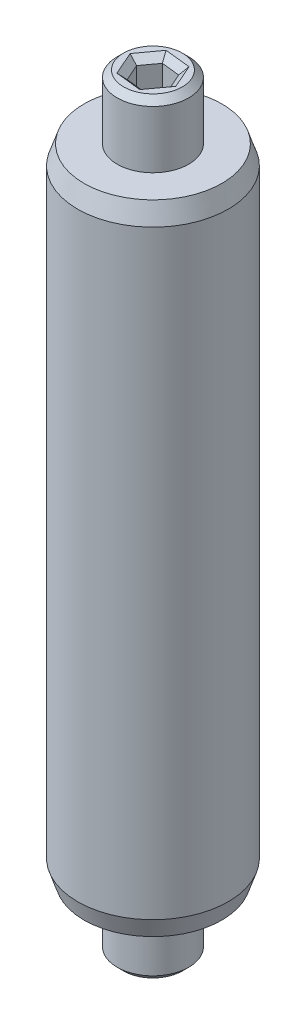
ISO-10303-21;
HEADER;
FILE_DESCRIPTION(('STEP AP214'),'2;1');
FILE_NAME('part.step','',(''),(''),'','','');
FILE_SCHEMA(('AUTOMOTIVE_DESIGN { 1 0 10303 214 1 1 1 1 }'));
ENDSEC;
DATA;
#1=APPLICATION_CONTEXT('core data for automotive mechanical design processes');
#2=APPLICATION_PROTOCOL_DEFINITION('international standard','automotive_design',2000,#1);
#3=PRODUCT_CONTEXT('',#1,'mechanical');
#4=PRODUCT('Part','Part','',(#3));
#5=PRODUCT_RELATED_PRODUCT_CATEGORY('part','',(#4));
#6=PRODUCT_DEFINITION_FORMATION('','',#4);
#7=PRODUCT_DEFINITION_CONTEXT('part definition',#1,'design');
#8=PRODUCT_DEFINITION('design','',#6,#7);
#9=PRODUCT_DEFINITION_SHAPE('','',#8);
#10=(LENGTH_UNIT() NAMED_UNIT(*) SI_UNIT(.MILLI.,.METRE.));
#11=(NAMED_UNIT(*) PLANE_ANGLE_UNIT() SI_UNIT($,.RADIAN.));
#12=(NAMED_UNIT(*) SI_UNIT($,.STERADIAN.) SOLID_ANGLE_UNIT());
#13=UNCERTAINTY_MEASURE_WITH_UNIT(LENGTH_MEASURE(1.E-05),#10,'distance_accuracy_value','');
#14=(GEOMETRIC_REPRESENTATION_CONTEXT(3) GLOBAL_UNCERTAINTY_ASSIGNED_CONTEXT((#13)) GLOBAL_UNIT_ASSIGNED_CONTEXT((#10,
#11,#12)) REPRESENTATION_CONTEXT('',''));
#15=CARTESIAN_POINT('',(0.,0.,0.));
#16=DIRECTION('',(0.,0.,1.));
#17=DIRECTION('',(1.,0.,0.));
#18=AXIS2_PLACEMENT_3D('',#15,#16,#17);
#19=CARTESIAN_POINT('',(-1.06592274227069,15.1859369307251,-1.12643595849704));
#20=DIRECTION('',(0.,-1.,0.));
#21=DIRECTION('',(0.,0.,-1.));
#22=AXIS2_PLACEMENT_3D('',#19,#20,#21);
#23=PLANE('',#22);
#24=CARTESIAN_POINT('',(-1.06592274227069,15.1859369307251,-1.12643595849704));
#25=DIRECTION('',(0.,-1.,0.));
#26=DIRECTION('',(0.,0.,-1.));
#27=AXIS2_PLACEMENT_3D('',#24,#25,#26);
#28=CIRCLE('',#27,1.3843);
#29=CARTESIAN_POINT('',(-1.06592274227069,15.1859369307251,0.257864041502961));
#30=VERTEX_POINT('',#29);
#31=EDGE_CURVE('P0_E11',#30,#30,#28,.T.);
#32=ORIENTED_EDGE('',*,*,#31,.T.);
#33=EDGE_LOOP('',(#32));
#34=FACE_BOUND('',#33,.T.);
#35=CARTESIAN_POINT('',(-1.06592274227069,15.1859369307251,-1.12643595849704));
#36=DIRECTION('',(0.,1.,0.));
#37=DIRECTION('',(0.,0.,1.));
#38=AXIS2_PLACEMENT_3D('',#35,#36,#37);
#39=CIRCLE('',#38,2.7432);
#40=CARTESIAN_POINT('',(-1.06592274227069,15.1859369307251,1.61676404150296));
#41=VERTEX_POINT('',#40);
#42=EDGE_CURVE('P0_E54',#41,#41,#39,.T.);
#43=ORIENTED_EDGE('',*,*,#42,.T.);
#44=EDGE_LOOP('',(#43));
#45=FACE_BOUND('',#44,.T.);
#46=ADVANCED_FACE('P0_F16',(#34,#45),#23,.F.);
#47=CARTESIAN_POINT('',(-1.06592274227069,14.4239369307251,-1.12643595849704));
#48=DIRECTION('',(0.,-1.,0.));
#49=DIRECTION('',(0.,0.,-1.));
#50=AXIS2_PLACEMENT_3D('',#47,#48,#49);
#51=CONICAL_SURFACE('',#50,2.9972,0.321750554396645);
#52=ORIENTED_EDGE('',*,*,#42,.F.);
#53=EDGE_LOOP('',(#52));
#54=FACE_BOUND('',#53,.T.);
#55=CARTESIAN_POINT('',(-1.06592274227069,14.4239369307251,-1.12643595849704));
#56=DIRECTION('',(0.,1.,0.));
#57=DIRECTION('',(0.,0.,1.));
#58=AXIS2_PLACEMENT_3D('',#55,#56,#57);
#59=CIRCLE('',#58,2.9972);
#60=CARTESIAN_POINT('',(-1.06592274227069,14.4239369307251,1.87076404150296));
#61=VERTEX_POINT('',#60);
#62=EDGE_CURVE('P0_E51',#61,#61,#59,.T.);
#63=ORIENTED_EDGE('',*,*,#62,.T.);
#64=EDGE_LOOP('',(#63));
#65=FACE_BOUND('',#64,.T.);
#66=ADVANCED_FACE('P0_F75',(#54,#65),#51,.T.);
#67=CARTESIAN_POINT('',(-1.06592274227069,15.1859369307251,-1.12643595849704));
#68=DIRECTION('',(0.,1.,0.));
#69=DIRECTION('',(0.,0.,1.));
#70=AXIS2_PLACEMENT_3D('',#67,#68,#69);
#71=CYLINDRICAL_SURFACE('',#70,2.9972);
#72=ORIENTED_EDGE('',*,*,#62,.F.);
#73=EDGE_LOOP('',(#72));
#74=FACE_BOUND('',#73,.T.);
#75=CARTESIAN_POINT('',(-1.06592274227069,-9.45206306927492,-1.12643595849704));
#76=DIRECTION('',(0.,1.,0.));
#77=DIRECTION('',(0.,0.,1.));
#78=AXIS2_PLACEMENT_3D('',#75,#76,#77);
#79=CIRCLE('',#78,2.9972);
#80=CARTESIAN_POINT('',(-1.06592274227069,-9.45206306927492,1.87076404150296));
#81=VERTEX_POINT('',#80);
#82=EDGE_CURVE('P0_E48',#81,#81,#79,.T.);
#83=ORIENTED_EDGE('',*,*,#82,.T.);
#84=EDGE_LOOP('',(#83));
#85=FACE_BOUND('',#84,.T.);
#86=ADVANCED_FACE('P0_F81',(#74,#85),#71,.T.);
#87=CARTESIAN_POINT('',(-1.06592274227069,-10.2140630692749,-1.12643595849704));
#88=DIRECTION('',(0.,1.,0.));
#89=DIRECTION('',(0.,0.,1.));
#90=AXIS2_PLACEMENT_3D('',#87,#88,#89);
#91=CONICAL_SURFACE('',#90,2.7432,0.321750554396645);
#92=ORIENTED_EDGE('',*,*,#82,.F.);
#93=EDGE_LOOP('',(#92));
#94=FACE_BOUND('',#93,.T.);
#95=CARTESIAN_POINT('',(-1.06592274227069,-10.2140630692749,-1.12643595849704));
#96=DIRECTION('',(0.,1.,0.));
#97=DIRECTION('',(0.,0.,1.));
#98=AXIS2_PLACEMENT_3D('',#95,#96,#97);
#99=CIRCLE('',#98,2.7432);
#100=CARTESIAN_POINT('',(-1.06592274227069,-10.2140630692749,1.61676404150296));
#101=VERTEX_POINT('',#100);
#102=EDGE_CURVE('P0_E43',#101,#101,#99,.T.);
#103=ORIENTED_EDGE('',*,*,#102,.T.);
#104=EDGE_LOOP('',(#103));
#105=FACE_BOUND('',#104,.T.);
#106=ADVANCED_FACE('P0_F88',(#94,#105),#91,.T.);
#107=CARTESIAN_POINT('',(1.67727725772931,-10.2140630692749,-1.12643595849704));
#108=DIRECTION('',(0.,1.,0.));
#109=DIRECTION('',(0.,0.,1.));
#110=AXIS2_PLACEMENT_3D('',#107,#108,#109);
#111=PLANE('',#110);
#112=CARTESIAN_POINT('',(-1.06592274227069,-10.2140630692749,-1.12643595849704));
#113=DIRECTION('',(0.,1.,0.));
#114=DIRECTION('',(0.,0.,1.));
#115=AXIS2_PLACEMENT_3D('',#112,#113,#114);
#116=CIRCLE('',#115,1.3843);
#117=CARTESIAN_POINT('',(-1.06592274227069,-10.2140630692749,-2.51073595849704));
#118=VERTEX_POINT('',#117);
#119=EDGE_CURVE('P0_E60',#118,#118,#116,.T.);
#120=ORIENTED_EDGE('',*,*,#119,.T.);
#121=EDGE_LOOP('',(#120));
#122=FACE_BOUND('',#121,.T.);
#123=ORIENTED_EDGE('',*,*,#102,.F.);
#124=EDGE_LOOP('',(#123));
#125=FACE_BOUND('',#124,.T.);
#126=ADVANCED_FACE('P0_F92',(#122,#125),#111,.F.);
#127=CARTESIAN_POINT('',(-1.06592274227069,-10.2140630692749,-1.12643595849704));
#128=DIRECTION('',(0.,-1.,0.));
#129=DIRECTION('',(0.,0.,-1.));
#130=AXIS2_PLACEMENT_3D('',#127,#128,#129);
#131=CYLINDRICAL_SURFACE('',#130,1.1303);
#132=CARTESIAN_POINT('',(-1.06592274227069,-9.77412216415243,-1.12643595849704));
#133=DIRECTION('',(0.,1.,0.));
#134=DIRECTION('',(0.,0.,1.));
#135=AXIS2_PLACEMENT_3D('',#132,#133,#134);
#136=CIRCLE('',#135,1.1303);
#137=CARTESIAN_POINT('',(-1.06592274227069,-9.77412216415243,-2.25673595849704));
#138=VERTEX_POINT('',#137);
#139=EDGE_CURVE('P0_E57',#138,#138,#136,.F.);
#140=ORIENTED_EDGE('',*,*,#139,.T.);
#141=EDGE_LOOP('',(#140));
#142=FACE_BOUND('',#141,.T.);
#143=CARTESIAN_POINT('',(-1.06592274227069,-4.49906306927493,-1.12643595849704));
#144=DIRECTION('',(0.,-1.,0.));
#145=DIRECTION('',(0.,0.,-1.));
#146=AXIS2_PLACEMENT_3D('',#143,#144,#145);
#147=CIRCLE('',#146,1.1303);
#148=CARTESIAN_POINT('',(-1.06592274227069,-4.49906306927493,-2.25673595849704));
#149=VERTEX_POINT('',#148);
#150=EDGE_CURVE('P0_E40',#149,#149,#147,.T.);
#151=ORIENTED_EDGE('',*,*,#150,.F.);
#152=EDGE_LOOP('',(#151));
#153=FACE_BOUND('',#152,.T.);
#154=ADVANCED_FACE('P0_F96',(#142,#153),#131,.F.);
#155=CARTESIAN_POINT('',(-1.06592274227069,-4.49906306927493,-1.12643595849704));
#156=DIRECTION('',(0.,-1.,0.));
#157=DIRECTION('',(0.,0.,-1.));
#158=AXIS2_PLACEMENT_3D('',#155,#156,#157);
#159=CONICAL_SURFACE('',#158,1.1303,1.02974425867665);
#160=CARTESIAN_POINT('',(-1.06592274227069,-3.81991031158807,-1.12643595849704));
#161=VERTEX_POINT('',#160);
#162=VERTEX_LOOP('',#161);
#163=FACE_BOUND('',#162,.T.);
#164=ORIENTED_EDGE('',*,*,#150,.T.);
#165=EDGE_LOOP('',(#164));
#166=FACE_BOUND('',#165,.T.);
#167=ADVANCED_FACE('P0_F100',(#163,#166),#159,.F.);
#168=CARTESIAN_POINT('',(-1.06592274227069,15.1859369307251,-1.12643595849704));
#169=DIRECTION('',(0.,1.,0.));
#170=DIRECTION('',(0.,0.,1.));
#171=AXIS2_PLACEMENT_3D('',#168,#169,#170);
#172=CYLINDRICAL_SURFACE('',#171,1.1303);
#173=CARTESIAN_POINT('',(-1.06592274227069,14.7459960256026,-1.12643595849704));
#174=DIRECTION('',(0.,-1.,0.));
#175=DIRECTION('',(0.,0.,-1.));
#176=AXIS2_PLACEMENT_3D('',#173,#174,#175);
#177=CIRCLE('',#176,1.1303);
#178=CARTESIAN_POINT('',(-1.06592274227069,14.7459960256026,0.00386404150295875));
#179=VERTEX_POINT('',#178);
#180=EDGE_CURVE('P0_E24',#179,#179,#177,.F.);
#181=ORIENTED_EDGE('',*,*,#180,.T.);
#182=EDGE_LOOP('',(#181));
#183=FACE_BOUND('',#182,.T.);
#184=CARTESIAN_POINT('',(-1.06592274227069,9.47093693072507,-1.12643595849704));
#185=DIRECTION('',(0.,1.,0.));
#186=DIRECTION('',(0.,0.,1.));
#187=AXIS2_PLACEMENT_3D('',#184,#185,#186);
#188=CIRCLE('',#187,1.1303);
#189=CARTESIAN_POINT('',(-1.06592274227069,9.47093693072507,0.00386404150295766));
#190=VERTEX_POINT('',#189);
#191=EDGE_CURVE('P0_E38',#190,#190,#188,.T.);
#192=ORIENTED_EDGE('',*,*,#191,.F.);
#193=EDGE_LOOP('',(#192));
#194=FACE_BOUND('',#193,.T.);
#195=ADVANCED_FACE('P0_F34',(#183,#194),#172,.F.);
#196=CARTESIAN_POINT('',(-1.06592274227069,9.47093693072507,-1.12643595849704));
#197=DIRECTION('',(0.,1.,0.));
#198=DIRECTION('',(0.,0.,1.));
#199=AXIS2_PLACEMENT_3D('',#196,#197,#198);
#200=CONICAL_SURFACE('',#199,1.1303,1.02974425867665);
#201=CARTESIAN_POINT('',(-1.06592274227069,8.79178417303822,-1.12643595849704));
#202=VERTEX_POINT('',#201);
#203=VERTEX_LOOP('',#202);
#204=FACE_BOUND('',#203,.T.);
#205=ORIENTED_EDGE('',*,*,#191,.T.);
#206=EDGE_LOOP('',(#205));
#207=FACE_BOUND('',#206,.T.);
#208=ADVANCED_FACE('P0_F30',(#204,#207),#200,.F.);
#209=CARTESIAN_POINT('',(-1.06592274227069,-9.77412216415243,-1.12643595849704));
#210=DIRECTION('',(0.,-1.,0.));
#211=DIRECTION('',(0.,0.,-1.));
#212=AXIS2_PLACEMENT_3D('',#209,#210,#211);
#213=CONICAL_SURFACE('',#212,1.1303,0.5235987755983);
#214=CARTESIAN_POINT('',(-1.06592274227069,-10.2140630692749,-2.51073595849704));
#215=CARTESIAN_POINT('',(-1.06592274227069,-10.2094803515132,-2.50809012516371));
#216=CARTESIAN_POINT('',(-1.06592274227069,-10.2048976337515,-2.50544429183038));
#217=CARTESIAN_POINT('',(-1.06592274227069,-10.1957321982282,-2.50015262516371));
#218=CARTESIAN_POINT('',(-1.06592274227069,-10.1911494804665,-2.49750679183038));
#219=CARTESIAN_POINT('',(-1.06592274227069,-10.1819840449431,-2.49221512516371));
#220=CARTESIAN_POINT('',(-1.06592274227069,-10.1774013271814,-2.48956929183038));
#221=CARTESIAN_POINT('',(-1.06592274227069,-10.168235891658,-2.48427762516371));
#222=CARTESIAN_POINT('',(-1.06592274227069,-10.1636531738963,-2.48163179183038));
#223=CARTESIAN_POINT('',(-1.06592274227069,-10.1544877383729,-2.47634012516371));
#224=CARTESIAN_POINT('',(-1.06592274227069,-10.1499050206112,-2.47369429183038));
#225=CARTESIAN_POINT('',(-1.06592274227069,-10.1407395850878,-2.46840262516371));
#226=CARTESIAN_POINT('',(-1.06592274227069,-10.1361568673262,-2.46575679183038));
#227=CARTESIAN_POINT('',(-1.06592274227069,-10.1269914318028,-2.46046512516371));
#228=CARTESIAN_POINT('',(-1.06592274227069,-10.1224087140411,-2.45781929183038));
#229=CARTESIAN_POINT('',(-1.06592274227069,-10.1132432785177,-2.45252762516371));
#230=CARTESIAN_POINT('',(-1.06592274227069,-10.108660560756,-2.44988179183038));
#231=CARTESIAN_POINT('',(-1.06592274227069,-10.0994951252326,-2.44459012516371));
#232=CARTESIAN_POINT('',(-1.06592274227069,-10.0949124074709,-2.44194429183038));
#233=CARTESIAN_POINT('',(-1.06592274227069,-10.0857469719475,-2.43665262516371));
#234=CARTESIAN_POINT('',(-1.06592274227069,-10.0811642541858,-2.43400679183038));
#235=CARTESIAN_POINT('',(-1.06592274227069,-10.0719988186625,-2.42871512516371));
#236=CARTESIAN_POINT('',(-1.06592274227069,-10.0674161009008,-2.42606929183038));
#237=CARTESIAN_POINT('',(-1.06592274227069,-10.0582506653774,-2.42077762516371));
#238=CARTESIAN_POINT('',(-1.06592274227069,-10.0536679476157,-2.41813179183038));
#239=CARTESIAN_POINT('',(-1.06592274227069,-10.0445025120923,-2.41284012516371));
#240=CARTESIAN_POINT('',(-1.06592274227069,-10.0399197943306,-2.41019429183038));
#241=CARTESIAN_POINT('',(-1.06592274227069,-10.0307543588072,-2.40490262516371));
#242=CARTESIAN_POINT('',(-1.06592274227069,-10.0261716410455,-2.40225679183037));
#243=CARTESIAN_POINT('',(-1.06592274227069,-10.0170062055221,-2.39696512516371));
#244=CARTESIAN_POINT('',(-1.06592274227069,-10.0124234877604,-2.39431929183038));
#245=CARTESIAN_POINT('',(-1.06592274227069,-10.0032580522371,-2.38902762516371));
#246=CARTESIAN_POINT('',(-1.06592274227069,-9.99867533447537,-2.38638179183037));
#247=CARTESIAN_POINT('',(-1.06592274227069,-9.98950989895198,-2.38109012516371));
#248=CARTESIAN_POINT('',(-1.06592274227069,-9.98492718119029,-2.37844429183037));
#249=CARTESIAN_POINT('',(-1.06592274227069,-9.97576174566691,-2.37315262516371));
#250=CARTESIAN_POINT('',(-1.06592274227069,-9.97117902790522,-2.37050679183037));
#251=CARTESIAN_POINT('',(-1.06592274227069,-9.96201359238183,-2.36521512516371));
#252=CARTESIAN_POINT('',(-1.06592274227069,-9.95743087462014,-2.36256929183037));
#253=CARTESIAN_POINT('',(-1.06592274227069,-9.94826543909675,-2.35727762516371));
#254=CARTESIAN_POINT('',(-1.06592274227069,-9.94368272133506,-2.35463179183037));
#255=CARTESIAN_POINT('',(-1.06592274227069,-9.93451728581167,-2.34934012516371));
#256=CARTESIAN_POINT('',(-1.06592274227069,-9.92993456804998,-2.34669429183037));
#257=CARTESIAN_POINT('',(-1.06592274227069,-9.92076913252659,-2.34140262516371));
#258=CARTESIAN_POINT('',(-1.06592274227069,-9.9161864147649,-2.33875679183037));
#259=CARTESIAN_POINT('',(-1.06592274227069,-9.90702097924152,-2.33346512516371));
#260=CARTESIAN_POINT('',(-1.06592274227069,-9.90243826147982,-2.33081929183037));
#261=CARTESIAN_POINT('',(-1.06592274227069,-9.89327282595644,-2.32552762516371));
#262=CARTESIAN_POINT('',(-1.06592274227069,-9.88869010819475,-2.32288179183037));
#263=CARTESIAN_POINT('',(-1.06592274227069,-9.87952467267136,-2.31759012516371));
#264=CARTESIAN_POINT('',(-1.06592274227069,-9.87494195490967,-2.31494429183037));
#265=CARTESIAN_POINT('',(-1.06592274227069,-9.86577651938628,-2.30965262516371));
#266=CARTESIAN_POINT('',(-1.06592274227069,-9.86119380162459,-2.30700679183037));
#267=CARTESIAN_POINT('',(-1.06592274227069,-9.8520283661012,-2.30171512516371));
#268=CARTESIAN_POINT('',(-1.06592274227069,-9.84744564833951,-2.29906929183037));
#269=CARTESIAN_POINT('',(-1.06592274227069,-9.83828021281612,-2.29377762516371));
#270=CARTESIAN_POINT('',(-1.06592274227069,-9.83369749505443,-2.29113179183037));
#271=CARTESIAN_POINT('',(-1.06592274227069,-9.82453205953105,-2.28584012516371));
#272=CARTESIAN_POINT('',(-1.06592274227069,-9.81994934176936,-2.28319429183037));
#273=CARTESIAN_POINT('',(-1.06592274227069,-9.81078390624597,-2.27790262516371));
#274=CARTESIAN_POINT('',(-1.06592274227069,-9.80620118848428,-2.27525679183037));
#275=CARTESIAN_POINT('',(-1.06592274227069,-9.79703575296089,-2.26996512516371));
#276=CARTESIAN_POINT('',(-1.06592274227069,-9.7924530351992,-2.26731929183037));
#277=CARTESIAN_POINT('',(-1.06592274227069,-9.78328759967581,-2.26202762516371));
#278=CARTESIAN_POINT('',(-1.06592274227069,-9.77870488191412,-2.25938179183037));
#279=CARTESIAN_POINT('',(-1.06592274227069,-9.77412216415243,-2.25673595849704));
#280=B_SPLINE_CURVE_WITH_KNOTS('',3,(#214,#215,#216,#217,#218,#219,#220,#221,#222,#223,#224,
#225,#226,#227,#228,#229,#230,#231,#232,#233,#234,#235,#236,#237,#238,#239,#240,#241,#242,#243,
#244,#245,#246,#247,#248,#249,#250,#251,#252,#253,#254,#255,#256,#257,#258,#259,#260,#261,#262,
#263,#264,#265,#266,#267,#268,#269,#270,#271,#272,#273,#274,#275,#276,#277,#278,#279),
.UNSPECIFIED.,.F.,.F.,(4,2,2,2,2,2,2,2,2,2,2,2,2,2,2,2,2,2,2,2,2,2,2,2,2,2,2,2,2,2,2,2,4),(0.,
0.0158750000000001,0.0317500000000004,0.0476250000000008,0.0635000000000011,0.0793750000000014,
0.0952500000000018,0.111125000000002,0.127000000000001,0.142875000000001,0.158750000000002,
0.174625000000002,0.190500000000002,0.206375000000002,0.222250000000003,0.238125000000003,
0.254000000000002,0.269875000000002,0.285750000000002,0.301625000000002,0.317500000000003,
0.333375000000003,0.349250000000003,0.365125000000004,0.381000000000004,0.396875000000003,
0.412750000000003,0.428625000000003,0.444500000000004,0.460375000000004,0.476250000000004,
0.492125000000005,0.508000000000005),.UNSPECIFIED.);
#281=EDGE_CURVE('P0_BSEAM33',#118,#138,#280,.T.);
#282=ORIENTED_EDGE('',*,*,#119,.F.);
#283=ORIENTED_EDGE('',*,*,#139,.F.);
#284=ORIENTED_EDGE('',*,*,#281,.T.);
#285=ORIENTED_EDGE('',*,*,#281,.F.);
#286=EDGE_LOOP('',(#282,#284,#283,#285));
#287=FACE_BOUND('',#286,.T.);
#288=ADVANCED_FACE('P0_F33',(#287),#213,.F.);
#289=CARTESIAN_POINT('',(-1.06592274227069,14.7459960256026,-1.12643595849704));
#290=DIRECTION('',(0.,1.,0.));
#291=DIRECTION('',(0.,0.,1.));
#292=AXIS2_PLACEMENT_3D('',#289,#290,#291);
#293=CONICAL_SURFACE('',#292,1.1303,0.5235987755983);
#294=CARTESIAN_POINT('',(-1.06592274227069,15.1859369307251,0.257864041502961));
#295=CARTESIAN_POINT('',(-1.06592274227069,15.1813542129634,0.255218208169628));
#296=CARTESIAN_POINT('',(-1.06592274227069,15.1767714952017,0.252572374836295));
#297=CARTESIAN_POINT('',(-1.06592274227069,15.1676060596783,0.247280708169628));
#298=CARTESIAN_POINT('',(-1.06592274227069,15.1630233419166,0.244634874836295));
#299=CARTESIAN_POINT('',(-1.06592274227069,15.1538579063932,0.239343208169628));
#300=CARTESIAN_POINT('',(-1.06592274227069,15.1492751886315,0.236697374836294));
#301=CARTESIAN_POINT('',(-1.06592274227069,15.1401097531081,0.231405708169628));
#302=CARTESIAN_POINT('',(-1.06592274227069,15.1355270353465,0.228759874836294));
#303=CARTESIAN_POINT('',(-1.06592274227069,15.1263615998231,0.223468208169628));
#304=CARTESIAN_POINT('',(-1.06592274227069,15.1217788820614,0.220822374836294));
#305=CARTESIAN_POINT('',(-1.06592274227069,15.112613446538,0.215530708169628));
#306=CARTESIAN_POINT('',(-1.06592274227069,15.1080307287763,0.212884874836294));
#307=CARTESIAN_POINT('',(-1.06592274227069,15.0988652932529,0.207593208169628));
#308=CARTESIAN_POINT('',(-1.06592274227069,15.0942825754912,0.204947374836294));
#309=CARTESIAN_POINT('',(-1.06592274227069,15.0851171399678,0.199655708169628));
#310=CARTESIAN_POINT('',(-1.06592274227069,15.0805344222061,0.197009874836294));
#311=CARTESIAN_POINT('',(-1.06592274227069,15.0713689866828,0.191718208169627));
#312=CARTESIAN_POINT('',(-1.06592274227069,15.0667862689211,0.189072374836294));
#313=CARTESIAN_POINT('',(-1.06592274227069,15.0576208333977,0.183780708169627));
#314=CARTESIAN_POINT('',(-1.06592274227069,15.053038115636,0.181134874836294));
#315=CARTESIAN_POINT('',(-1.06592274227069,15.0438726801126,0.175843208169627));
#316=CARTESIAN_POINT('',(-1.06592274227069,15.0392899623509,0.173197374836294));
#317=CARTESIAN_POINT('',(-1.06592274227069,15.0301245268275,0.167905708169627));
#318=CARTESIAN_POINT('',(-1.06592274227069,15.0255418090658,0.165259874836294));
#319=CARTESIAN_POINT('',(-1.06592274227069,15.0163763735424,0.159968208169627));
#320=CARTESIAN_POINT('',(-1.06592274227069,15.0117936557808,0.157322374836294));
#321=CARTESIAN_POINT('',(-1.06592274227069,15.0026282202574,0.152030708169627));
#322=CARTESIAN_POINT('',(-1.06592274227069,14.9980455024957,0.149384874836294));
#323=CARTESIAN_POINT('',(-1.06592274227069,14.9888800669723,0.144093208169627));
#324=CARTESIAN_POINT('',(-1.06592274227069,14.9842973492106,0.141447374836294));
#325=CARTESIAN_POINT('',(-1.06592274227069,14.9751319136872,0.136155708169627));
#326=CARTESIAN_POINT('',(-1.06592274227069,14.9705491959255,0.133509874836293));
#327=CARTESIAN_POINT('',(-1.06592274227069,14.9613837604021,0.128218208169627));
#328=CARTESIAN_POINT('',(-1.06592274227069,14.9568010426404,0.125572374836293));
#329=CARTESIAN_POINT('',(-1.06592274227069,14.9476356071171,0.120280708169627));
#330=CARTESIAN_POINT('',(-1.06592274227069,14.9430528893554,0.117634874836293));
#331=CARTESIAN_POINT('',(-1.06592274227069,14.933887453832,0.112343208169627));
#332=CARTESIAN_POINT('',(-1.06592274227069,14.9293047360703,0.109697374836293));
#333=CARTESIAN_POINT('',(-1.06592274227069,14.9201393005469,0.104405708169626));
#334=CARTESIAN_POINT('',(-1.06592274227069,14.9155565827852,0.101759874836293));
#335=CARTESIAN_POINT('',(-1.06592274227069,14.9063911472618,0.0964682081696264));
#336=CARTESIAN_POINT('',(-1.06592274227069,14.9018084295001,0.0938223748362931));
#337=CARTESIAN_POINT('',(-1.06592274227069,14.8926429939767,0.0885307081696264));
#338=CARTESIAN_POINT('',(-1.06592274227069,14.8880602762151,0.085884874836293));
#339=CARTESIAN_POINT('',(-1.06592274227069,14.8788948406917,0.0805932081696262));
#340=CARTESIAN_POINT('',(-1.06592274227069,14.87431212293,0.0779473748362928));
#341=CARTESIAN_POINT('',(-1.06592274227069,14.8651466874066,0.0726557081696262));
#342=CARTESIAN_POINT('',(-1.06592274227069,14.8605639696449,0.0700098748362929));
#343=CARTESIAN_POINT('',(-1.06592274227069,14.8513985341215,0.0647182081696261));
#344=CARTESIAN_POINT('',(-1.06592274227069,14.8468158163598,0.0620723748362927));
#345=CARTESIAN_POINT('',(-1.06592274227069,14.8376503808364,0.056780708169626));
#346=CARTESIAN_POINT('',(-1.06592274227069,14.8330676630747,0.0541348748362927));
#347=CARTESIAN_POINT('',(-1.06592274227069,14.8239022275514,0.048843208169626));
#348=CARTESIAN_POINT('',(-1.06592274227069,14.8193195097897,0.0461973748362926));
#349=CARTESIAN_POINT('',(-1.06592274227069,14.8101540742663,0.0409057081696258));
#350=CARTESIAN_POINT('',(-1.06592274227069,14.8055713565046,0.0382598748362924));
#351=CARTESIAN_POINT('',(-1.06592274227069,14.7964059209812,0.0329682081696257));
#352=CARTESIAN_POINT('',(-1.06592274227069,14.7918232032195,0.0303223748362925));
#353=CARTESIAN_POINT('',(-1.06592274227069,14.7826577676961,0.0250307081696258));
#354=CARTESIAN_POINT('',(-1.06592274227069,14.7780750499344,0.0223848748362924));
#355=CARTESIAN_POINT('',(-1.06592274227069,14.768909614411,0.0170932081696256));
#356=CARTESIAN_POINT('',(-1.06592274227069,14.7643268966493,0.0144473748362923));
#357=CARTESIAN_POINT('',(-1.06592274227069,14.755161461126,0.0091557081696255));
#358=CARTESIAN_POINT('',(-1.06592274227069,14.7505787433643,0.00650987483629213));
#359=CARTESIAN_POINT('',(-1.06592274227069,14.7459960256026,0.00386404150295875));
#360=B_SPLINE_CURVE_WITH_KNOTS('',3,(#294,#295,#296,#297,#298,#299,#300,#301,#302,#303,#304,
#305,#306,#307,#308,#309,#310,#311,#312,#313,#314,#315,#316,#317,#318,#319,#320,#321,#322,#323,
#324,#325,#326,#327,#328,#329,#330,#331,#332,#333,#334,#335,#336,#337,#338,#339,#340,#341,#342,
#343,#344,#345,#346,#347,#348,#349,#350,#351,#352,#353,#354,#355,#356,#357,#358,#359),
.UNSPECIFIED.,.F.,.F.,(4,2,2,2,2,2,2,2,2,2,2,2,2,2,2,2,2,2,2,2,2,2,2,2,2,2,2,2,2,2,2,2,4),(0.,
0.0158750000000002,0.0317500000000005,0.0476250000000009,0.0635000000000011,0.0793750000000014,
0.0952500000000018,0.111125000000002,0.127000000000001,0.142875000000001,0.158750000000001,
0.174625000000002,0.190500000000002,0.206375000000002,0.222250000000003,0.238125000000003,
0.254000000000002,0.269875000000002,0.285750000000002,0.301625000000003,0.317500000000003,
0.333375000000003,0.349250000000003,0.365125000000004,0.381000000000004,0.396875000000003,
0.412750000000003,0.428625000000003,0.444500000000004,0.460375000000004,0.476250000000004,
0.492125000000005,0.508000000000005),.UNSPECIFIED.);
#361=EDGE_CURVE('P0_BSEAM18',#30,#179,#360,.T.);
#362=ORIENTED_EDGE('',*,*,#31,.F.);
#363=ORIENTED_EDGE('',*,*,#180,.F.);
#364=ORIENTED_EDGE('',*,*,#361,.T.);
#365=ORIENTED_EDGE('',*,*,#361,.F.);
#366=EDGE_LOOP('',(#362,#364,#363,#365));
#367=FACE_BOUND('',#366,.T.);
#368=ADVANCED_FACE('P0_F18',(#367),#293,.F.);
#369=CLOSED_SHELL('',(#46,#66,#86,#106,#126,#154,#167,#195,#208,#288,#368));
#370=MANIFOLD_SOLID_BREP('P0_B1',#369);
#371=CARTESIAN_POINT('',(-1.64154912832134,11.3759369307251,-2.42715730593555));
#372=DIRECTION('',(0.,1.,0.));
#373=DIRECTION('',(-0.914455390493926,0.,0.404686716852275));
#374=AXIS2_PLACEMENT_3D('',#371,#372,#373);
#375=PLANE('',#374);
#376=CARTESIAN_POINT('',(-1.06592274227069,11.3759369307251,-1.12643595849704));
#377=DIRECTION('',(0.,1.,0.));
#378=DIRECTION('',(-0.914455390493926,0.,0.404686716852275));
#379=AXIS2_PLACEMENT_3D('',#376,#377,#378);
#380=CIRCLE('',#379,1.1684);
#381=CARTESIAN_POINT('',(-2.13437242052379,11.3759369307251,-0.653599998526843));
#382=VERTEX_POINT('',#381);
#383=EDGE_CURVE('P1_E126',#382,#382,#380,.F.);
#384=ORIENTED_EDGE('',*,*,#383,.T.);
#385=EDGE_LOOP('',(#384));
#386=FACE_BOUND('',#385,.T.);
#387=ADVANCED_FACE('P1_F16',(#386),#375,.F.);
#388=CARTESIAN_POINT('',(-1.06592274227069,17.7259369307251,-1.12643595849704));
#389=DIRECTION('',(0.,-1.,0.));
#390=DIRECTION('',(0.914455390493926,0.,-0.404686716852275));
#391=AXIS2_PLACEMENT_3D('',#388,#389,#390);
#392=PLANE('',#391);
#393=DIRECTION('',(-0.589598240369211,0.,0.807696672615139));
#394=VECTOR('',#393,1.);
#395=CARTESIAN_POINT('',(-0.347880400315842,17.7259369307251,-0.602283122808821));
#396=LINE('',#395,#394);
#397=CARTESIAN_POINT('',(-0.0452606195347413,17.7259369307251,-1.016845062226));
#398=VERTEX_POINT('',#397);
#399=CARTESIAN_POINT('',(-0.65050018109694,17.7259369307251,-0.187721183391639));
#400=VERTEX_POINT('',#399);
#401=EDGE_CURVE('P1_E157',#398,#400,#396,.T.);
#402=ORIENTED_EDGE('',*,*,#401,.T.);
#403=DIRECTION('',(-0.994284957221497,0.,-0.106758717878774));
#404=VECTOR('',#403,1.);
#405=CARTESIAN_POINT('',(-1.16083124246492,17.7259369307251,-0.242516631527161));
#406=LINE('',#405,#404);
#407=CARTESIAN_POINT('',(-1.67116230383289,17.7259369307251,-0.297312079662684));
#408=VERTEX_POINT('',#407);
#409=EDGE_CURVE('P1_E159',#400,#408,#406,.T.);
#410=ORIENTED_EDGE('',*,*,#409,.T.);
#411=DIRECTION('',(-0.404686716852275,0.,-0.914455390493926));
#412=VECTOR('',#411,1.);
#413=CARTESIAN_POINT('',(-1.87887358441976,17.7259369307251,-0.766669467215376));
#414=LINE('',#413,#412);
#415=CARTESIAN_POINT('',(-2.08658486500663,17.7259369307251,-1.23602685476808));
#416=VERTEX_POINT('',#415);
#417=EDGE_CURVE('P1_E149',#408,#416,#414,.T.);
#418=ORIENTED_EDGE('',*,*,#417,.T.);
#419=DIRECTION('',(0.589598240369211,0.,-0.807696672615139));
#420=VECTOR('',#419,1.);
#421=CARTESIAN_POINT('',(-1.78396508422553,17.7259369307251,-1.65058879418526));
#422=LINE('',#421,#420);
#423=CARTESIAN_POINT('',(-1.48134530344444,17.7259369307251,-2.06515073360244));
#424=VERTEX_POINT('',#423);
#425=EDGE_CURVE('P1_E151',#416,#424,#422,.T.);
#426=ORIENTED_EDGE('',*,*,#425,.T.);
#427=DIRECTION('',(0.994284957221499,0.,0.106758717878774));
#428=VECTOR('',#427,1.);
#429=CARTESIAN_POINT('',(-0.971014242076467,17.7259369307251,-2.01035528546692));
#430=LINE('',#429,#428);
#431=CARTESIAN_POINT('',(-0.460683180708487,17.7259369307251,-1.9555598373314));
#432=VERTEX_POINT('',#431);
#433=EDGE_CURVE('P1_E153',#424,#432,#430,.T.);
#434=ORIENTED_EDGE('',*,*,#433,.T.);
#435=DIRECTION('',(0.404686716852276,0.,0.914455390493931));
#436=VECTOR('',#435,1.);
#437=CARTESIAN_POINT('',(-0.252971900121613,17.7259369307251,-1.4862024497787));
#438=LINE('',#437,#436);
#439=EDGE_CURVE('P1_E155',#432,#398,#438,.T.);
#440=ORIENTED_EDGE('',*,*,#439,.T.);
#441=EDGE_LOOP('',(#402,#410,#418,#426,#434,#440));
#442=FACE_BOUND('',#441,.T.);
#443=CARTESIAN_POINT('',(-1.06592274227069,17.7259369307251,-1.12643595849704));
#444=DIRECTION('',(0.,-1.,0.));
#445=DIRECTION('',(0.914455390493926,0.,-0.404686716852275));
#446=AXIS2_PLACEMENT_3D('',#443,#444,#445);
#447=CIRCLE('',#446,1.1684);
#448=CARTESIAN_POINT('',(0.00252693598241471,17.7259369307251,-1.59927191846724));
#449=VERTEX_POINT('',#448);
#450=EDGE_CURVE('P1_E143',#449,#449,#447,.F.);
#451=ORIENTED_EDGE('',*,*,#450,.T.);
#452=EDGE_LOOP('',(#451));
#453=FACE_BOUND('',#452,.T.);
#454=ADVANCED_FACE('P1_F206',(#442,#453),#392,.F.);
#455=CARTESIAN_POINT('',(-1.06592274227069,11.3759369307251,-1.12643595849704));
#456=DIRECTION('',(0.,-1.,0.));
#457=DIRECTION('',(0.914455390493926,0.,-0.404686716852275));
#458=AXIS2_PLACEMENT_3D('',#455,#456,#457);
#459=CYLINDRICAL_SURFACE('',#458,1.4224);
#460=CARTESIAN_POINT('',(-1.06592274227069,11.6299369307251,-1.12643595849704));
#461=DIRECTION('',(0.,1.,0.));
#462=DIRECTION('',(-0.914455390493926,0.,0.404686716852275));
#463=AXIS2_PLACEMENT_3D('',#460,#461,#462);
#464=CIRCLE('',#463,1.4224);
#465=CARTESIAN_POINT('',(-2.36664408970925,11.6299369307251,-0.550809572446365));
#466=VERTEX_POINT('',#465);
#467=EDGE_CURVE('P1_E140',#466,#466,#464,.T.);
#468=ORIENTED_EDGE('',*,*,#467,.T.);
#469=EDGE_LOOP('',(#468));
#470=FACE_BOUND('',#469,.T.);
#471=CARTESIAN_POINT('',(-1.06592274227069,17.4719369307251,-1.12643595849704));
#472=DIRECTION('',(0.,-1.,0.));
#473=DIRECTION('',(0.914455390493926,0.,-0.404686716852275));
#474=AXIS2_PLACEMENT_3D('',#471,#472,#473);
#475=CIRCLE('',#474,1.4224);
#476=CARTESIAN_POINT('',(0.234798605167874,17.4719369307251,-1.70206234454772));
#477=VERTEX_POINT('',#476);
#478=EDGE_CURVE('P1_E137',#477,#477,#475,.T.);
#479=ORIENTED_EDGE('',*,*,#478,.T.);
#480=EDGE_LOOP('',(#479));
#481=FACE_BOUND('',#480,.T.);
#482=ADVANCED_FACE('P1_F224',(#470,#481),#459,.T.);
#483=CARTESIAN_POINT('',(-1.06592274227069,11.3759369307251,-1.12643595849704));
#484=DIRECTION('',(0.,1.,0.));
#485=DIRECTION('',(-0.914455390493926,0.,0.404686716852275));
#486=AXIS2_PLACEMENT_3D('',#483,#484,#485);
#487=CONICAL_SURFACE('',#486,1.1684,0.785398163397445);
#488=ORIENTED_EDGE('',*,*,#467,.F.);
#489=EDGE_LOOP('',(#488));
#490=FACE_BOUND('',#489,.T.);
#491=ORIENTED_EDGE('',*,*,#383,.F.);
#492=EDGE_LOOP('',(#491));
#493=FACE_BOUND('',#492,.T.);
#494=ADVANCED_FACE('P1_F227',(#490,#493),#487,.T.);
#495=CARTESIAN_POINT('',(-1.06592274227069,17.4719369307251,-1.12643595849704));
#496=DIRECTION('',(0.,-1.,0.));
#497=DIRECTION('',(0.914455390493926,0.,-0.404686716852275));
#498=AXIS2_PLACEMENT_3D('',#495,#496,#497);
#499=CONICAL_SURFACE('',#498,1.4224,0.78539816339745);
#500=ORIENTED_EDGE('',*,*,#450,.F.);
#501=EDGE_LOOP('',(#500));
#502=FACE_BOUND('',#501,.T.);
#503=ORIENTED_EDGE('',*,*,#478,.F.);
#504=EDGE_LOOP('',(#503));
#505=FACE_BOUND('',#504,.T.);
#506=ADVANCED_FACE('P1_F229',(#502,#505),#499,.T.);
#507=CARTESIAN_POINT('',(-0.769192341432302,16.4559369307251,-0.455925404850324));
#508=DIRECTION('',(0.807696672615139,0.,0.589598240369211));
#509=DIRECTION('',(0.589598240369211,0.,-0.807696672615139));
#510=AXIS2_PLACEMENT_3D('',#507,#508,#509);
#511=PLANE('',#510);
#512=DIRECTION('',(0.,1.,0.));
#513=VECTOR('',#512,1.);
#514=CARTESIAN_POINT('',(-0.769192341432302,16.4559369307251,-0.455925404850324));
#515=LINE('',#514,#513);
#516=CARTESIAN_POINT('',(-0.769192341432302,16.4559369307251,-0.455925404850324));
#517=VERTEX_POINT('',#516);
#518=CARTESIAN_POINT('',(-0.769192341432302,17.4719369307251,-0.455925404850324));
#519=VERTEX_POINT('',#518);
#520=EDGE_CURVE('P1_E124',#517,#519,#515,.T.);
#521=ORIENTED_EDGE('',*,*,#520,.T.);
#522=DIRECTION('',(0.589598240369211,0.,-0.807696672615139));
#523=VECTOR('',#522,1.);
#524=CARTESIAN_POINT('',(-0.769192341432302,17.4719369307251,-0.455925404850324));
#525=LINE('',#524,#523);
#526=CARTESIAN_POINT('',(-0.336878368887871,17.4719369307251,-1.04815674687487));
#527=VERTEX_POINT('',#526);
#528=EDGE_CURVE('P1_E93',#519,#527,#525,.T.);
#529=ORIENTED_EDGE('',*,*,#528,.T.);
#530=DIRECTION('',(0.,1.,0.));
#531=VECTOR('',#530,1.);
#532=CARTESIAN_POINT('',(-0.336878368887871,16.4559369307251,-1.04815674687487));
#533=LINE('',#532,#531);
#534=CARTESIAN_POINT('',(-0.336878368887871,16.4559369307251,-1.04815674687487));
#535=VERTEX_POINT('',#534);
#536=EDGE_CURVE('P1_E85',#535,#527,#533,.T.);
#537=ORIENTED_EDGE('',*,*,#536,.F.);
#538=DIRECTION('',(0.589598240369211,0.,-0.807696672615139));
#539=VECTOR('',#538,1.);
#540=CARTESIAN_POINT('',(-0.769192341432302,16.4559369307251,-0.455925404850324));
#541=LINE('',#540,#539);
#542=EDGE_CURVE('P1_E90',#517,#535,#541,.T.);
#543=ORIENTED_EDGE('',*,*,#542,.F.);
#544=EDGE_LOOP('',(#521,#529,#537,#543));
#545=FACE_BOUND('',#544,.T.);
#546=ADVANCED_FACE('P1_F88',(#545),#511,.F.);
#547=CARTESIAN_POINT('',(-1.49823671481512,16.4559369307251,-0.534204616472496));
#548=DIRECTION('',(-0.106758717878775,0.,0.994284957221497));
#549=DIRECTION('',(0.994284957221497,0.,0.106758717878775));
#550=AXIS2_PLACEMENT_3D('',#547,#548,#549);
#551=PLANE('',#550);
#552=DIRECTION('',(0.,1.,0.));
#553=VECTOR('',#552,1.);
#554=CARTESIAN_POINT('',(-1.49823671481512,16.4559369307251,-0.534204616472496));
#555=LINE('',#554,#553);
#556=CARTESIAN_POINT('',(-1.49823671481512,16.4559369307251,-0.534204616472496));
#557=VERTEX_POINT('',#556);
#558=CARTESIAN_POINT('',(-1.49823671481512,17.4719369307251,-0.534204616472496));
#559=VERTEX_POINT('',#558);
#560=EDGE_CURVE('P1_E127',#557,#559,#555,.T.);
#561=ORIENTED_EDGE('',*,*,#560,.T.);
#562=DIRECTION('',(0.994284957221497,0.,0.106758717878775));
#563=VECTOR('',#562,1.);
#564=CARTESIAN_POINT('',(-1.49823671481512,17.4719369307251,-0.534204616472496));
#565=LINE('',#564,#563);
#566=EDGE_CURVE('P1_E146',#559,#519,#565,.T.);
#567=ORIENTED_EDGE('',*,*,#566,.T.);
#568=ORIENTED_EDGE('',*,*,#520,.F.);
#569=DIRECTION('',(0.994284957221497,0.,0.106758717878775));
#570=VECTOR('',#569,1.);
#571=CARTESIAN_POINT('',(-1.49823671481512,16.4559369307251,-0.534204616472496));
#572=LINE('',#571,#570);
#573=EDGE_CURVE('P1_E97',#557,#517,#572,.T.);
#574=ORIENTED_EDGE('',*,*,#573,.F.);
#575=EDGE_LOOP('',(#561,#567,#568,#574));
#576=FACE_BOUND('',#575,.T.);
#577=ADVANCED_FACE('P1_F195',(#576),#551,.F.);
#578=CARTESIAN_POINT('',(-1.79496711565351,16.4559369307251,-1.20471517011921));
#579=DIRECTION('',(-0.914455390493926,0.,0.404686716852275));
#580=DIRECTION('',(0.404686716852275,0.,0.914455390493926));
#581=AXIS2_PLACEMENT_3D('',#578,#579,#580);
#582=PLANE('',#581);
#583=DIRECTION('',(0.,1.,0.));
#584=VECTOR('',#583,1.);
#585=CARTESIAN_POINT('',(-1.79496711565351,16.4559369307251,-1.20471517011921));
#586=LINE('',#585,#584);
#587=CARTESIAN_POINT('',(-1.79496711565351,16.4559369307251,-1.20471517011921));
#588=VERTEX_POINT('',#587);
#589=CARTESIAN_POINT('',(-1.79496711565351,17.4719369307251,-1.20471517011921));
#590=VERTEX_POINT('',#589);
#591=EDGE_CURVE('P1_E130',#588,#590,#586,.T.);
#592=ORIENTED_EDGE('',*,*,#591,.T.);
#593=DIRECTION('',(0.404686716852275,0.,0.914455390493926));
#594=VECTOR('',#593,1.);
#595=CARTESIAN_POINT('',(-1.79496711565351,17.4719369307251,-1.20471517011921));
#596=LINE('',#595,#594);
#597=EDGE_CURVE('P1_E11',#590,#559,#596,.T.);
#598=ORIENTED_EDGE('',*,*,#597,.T.);
#599=ORIENTED_EDGE('',*,*,#560,.F.);
#600=DIRECTION('',(0.404686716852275,0.,0.914455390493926));
#601=VECTOR('',#600,1.);
#602=CARTESIAN_POINT('',(-1.79496711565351,16.4559369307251,-1.20471517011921));
#603=LINE('',#602,#601);
#604=EDGE_CURVE('P1_E121',#588,#557,#603,.T.);
#605=ORIENTED_EDGE('',*,*,#604,.F.);
#606=EDGE_LOOP('',(#592,#598,#599,#605));
#607=FACE_BOUND('',#606,.T.);
#608=ADVANCED_FACE('P1_F251',(#607),#582,.F.);
#609=CARTESIAN_POINT('',(-1.36265314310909,16.4559369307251,-1.79694651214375));
#610=DIRECTION('',(-0.807696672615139,0.,-0.589598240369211));
#611=DIRECTION('',(-0.589598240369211,0.,0.807696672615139));
#612=AXIS2_PLACEMENT_3D('',#609,#610,#611);
#613=PLANE('',#612);
#614=DIRECTION('',(0.,1.,0.));
#615=VECTOR('',#614,1.);
#616=CARTESIAN_POINT('',(-1.36265314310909,16.4559369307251,-1.79694651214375));
#617=LINE('',#616,#615);
#618=CARTESIAN_POINT('',(-1.36265314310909,16.4559369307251,-1.79694651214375));
#619=VERTEX_POINT('',#618);
#620=CARTESIAN_POINT('',(-1.36265314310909,17.4719369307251,-1.79694651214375));
#621=VERTEX_POINT('',#620);
#622=EDGE_CURVE('P1_E132',#619,#621,#617,.T.);
#623=ORIENTED_EDGE('',*,*,#622,.T.);
#624=DIRECTION('',(-0.589598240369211,0.,0.807696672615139));
#625=VECTOR('',#624,1.);
#626=CARTESIAN_POINT('',(-1.36265314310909,17.4719369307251,-1.79694651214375));
#627=LINE('',#626,#625);
#628=EDGE_CURVE('P1_E23',#621,#590,#627,.T.);
#629=ORIENTED_EDGE('',*,*,#628,.T.);
#630=ORIENTED_EDGE('',*,*,#591,.F.);
#631=DIRECTION('',(-0.589598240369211,0.,0.807696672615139));
#632=VECTOR('',#631,1.);
#633=CARTESIAN_POINT('',(-1.36265314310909,16.4559369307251,-1.79694651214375));
#634=LINE('',#633,#632);
#635=EDGE_CURVE('P1_E118',#619,#588,#634,.T.);
#636=ORIENTED_EDGE('',*,*,#635,.F.);
#637=EDGE_LOOP('',(#623,#629,#630,#636));
#638=FACE_BOUND('',#637,.T.);
#639=ADVANCED_FACE('P1_F248',(#638),#613,.F.);
#640=CARTESIAN_POINT('',(-0.633608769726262,16.4559369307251,-1.71866730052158));
#641=DIRECTION('',(0.106758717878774,0.,-0.994284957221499));
#642=DIRECTION('',(-0.9942849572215,0.,-0.106758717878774));
#643=AXIS2_PLACEMENT_3D('',#640,#641,#642);
#644=PLANE('',#643);
#645=DIRECTION('',(0.,1.,0.));
#646=VECTOR('',#645,1.);
#647=CARTESIAN_POINT('',(-0.633608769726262,16.4559369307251,-1.71866730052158));
#648=LINE('',#647,#646);
#649=CARTESIAN_POINT('',(-0.633608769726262,16.4559369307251,-1.71866730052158));
#650=VERTEX_POINT('',#649);
#651=CARTESIAN_POINT('',(-0.633608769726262,17.4719369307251,-1.71866730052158));
#652=VERTEX_POINT('',#651);
#653=EDGE_CURVE('P1_E96',#650,#652,#648,.T.);
#654=ORIENTED_EDGE('',*,*,#653,.T.);
#655=DIRECTION('',(-0.9942849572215,0.,-0.106758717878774));
#656=VECTOR('',#655,1.);
#657=CARTESIAN_POINT('',(-0.633608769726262,17.4719369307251,-1.71866730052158));
#658=LINE('',#657,#656);
#659=EDGE_CURVE('P1_E37',#652,#621,#658,.T.);
#660=ORIENTED_EDGE('',*,*,#659,.T.);
#661=ORIENTED_EDGE('',*,*,#622,.F.);
#662=DIRECTION('',(-0.994284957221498,0.,-0.106758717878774));
#663=VECTOR('',#662,1.);
#664=CARTESIAN_POINT('',(-0.633608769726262,16.4559369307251,-1.71866730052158));
#665=LINE('',#664,#663);
#666=EDGE_CURVE('P1_E105',#650,#619,#665,.T.);
#667=ORIENTED_EDGE('',*,*,#666,.F.);
#668=EDGE_LOOP('',(#654,#660,#661,#667));
#669=FACE_BOUND('',#668,.T.);
#670=ADVANCED_FACE('P1_F169',(#669),#644,.F.);
#671=CARTESIAN_POINT('',(-0.336878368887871,16.4559369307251,-1.04815674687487));
#672=DIRECTION('',(0.914455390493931,0.,-0.404686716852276));
#673=DIRECTION('',(-0.404686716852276,0.,-0.914455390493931));
#674=AXIS2_PLACEMENT_3D('',#671,#672,#673);
#675=PLANE('',#674);
#676=ORIENTED_EDGE('',*,*,#536,.T.);
#677=DIRECTION('',(-0.404686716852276,0.,-0.914455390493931));
#678=VECTOR('',#677,1.);
#679=CARTESIAN_POINT('',(-0.336878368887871,17.4719369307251,-1.04815674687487));
#680=LINE('',#679,#678);
#681=EDGE_CURVE('P1_E163',#527,#652,#680,.T.);
#682=ORIENTED_EDGE('',*,*,#681,.T.);
#683=ORIENTED_EDGE('',*,*,#653,.F.);
#684=DIRECTION('',(-0.404686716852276,0.,-0.914455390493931));
#685=VECTOR('',#684,1.);
#686=CARTESIAN_POINT('',(-0.336878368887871,16.4559369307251,-1.04815674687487));
#687=LINE('',#686,#685);
#688=EDGE_CURVE('P1_E100',#535,#650,#687,.T.);
#689=ORIENTED_EDGE('',*,*,#688,.F.);
#690=EDGE_LOOP('',(#676,#682,#683,#689));
#691=FACE_BOUND('',#690,.T.);
#692=ADVANCED_FACE('P1_F101',(#691),#675,.F.);
#693=CARTESIAN_POINT('',(-1.20150631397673,16.4559369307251,0.136305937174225));
#694=DIRECTION('',(0.,-1.,0.));
#695=DIRECTION('',(0.914455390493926,0.,-0.404686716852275));
#696=AXIS2_PLACEMENT_3D('',#693,#694,#695);
#697=PLANE('',#696);
#698=ORIENTED_EDGE('',*,*,#542,.T.);
#699=ORIENTED_EDGE('',*,*,#688,.T.);
#700=ORIENTED_EDGE('',*,*,#666,.T.);
#701=ORIENTED_EDGE('',*,*,#635,.T.);
#702=ORIENTED_EDGE('',*,*,#604,.T.);
#703=ORIENTED_EDGE('',*,*,#573,.T.);
#704=EDGE_LOOP('',(#698,#699,#700,#701,#702,#703));
#705=FACE_BOUND('',#704,.T.);
#706=ADVANCED_FACE('P1_F107',(#705),#697,.F.);
#707=CARTESIAN_POINT('',(-0.633608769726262,17.4719369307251,-1.71866730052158));
#708=DIRECTION('',(0.0754898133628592,-0.707106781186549,-0.703065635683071));
#709=DIRECTION('',(0.305914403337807,-0.654653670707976,0.691263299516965));
#710=AXIS2_PLACEMENT_3D('',#707,#708,#709);
#711=PLANE('',#710);
#712=DIRECTION('',(0.445694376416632,0.654653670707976,-0.610561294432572));
#713=VECTOR('',#712,1.);
#714=CARTESIAN_POINT('',(-0.757127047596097,17.2905083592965,-1.54945834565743));
#715=LINE('',#714,#713);
#716=EDGE_CURVE('P1_E113',#432,#652,#715,.F.);
#717=ORIENTED_EDGE('',*,*,#716,.F.);
#718=ORIENTED_EDGE('',*,*,#433,.F.);
#719=DIRECTION('',(-0.305914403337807,0.654653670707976,-0.691263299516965));
#720=VECTOR('',#719,1.);
#721=CARTESIAN_POINT('',(-1.27787302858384,17.2905083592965,-1.60537206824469));
#722=LINE('',#721,#720);
#723=EDGE_CURVE('P1_E110',#621,#424,#722,.T.);
#724=ORIENTED_EDGE('',*,*,#723,.F.);
#725=ORIENTED_EDGE('',*,*,#659,.F.);
#726=EDGE_LOOP('',(#717,#718,#724,#725));
#727=FACE_BOUND('',#726,.T.);
#728=ADVANCED_FACE('P1_F173',(#727),#711,.F.);
#729=CARTESIAN_POINT('',(-1.36265314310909,17.4719369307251,-1.79694651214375));
#730=DIRECTION('',(-0.571127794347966,-0.707106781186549,-0.416908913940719));
#731=DIRECTION('',(0.305914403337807,-0.654653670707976,0.691263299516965));
#732=AXIS2_PLACEMENT_3D('',#729,#730,#731);
#733=PLANE('',#732);
#734=ORIENTED_EDGE('',*,*,#723,.T.);
#735=ORIENTED_EDGE('',*,*,#425,.F.);
#736=DIRECTION('',(-0.751608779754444,0.654653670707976,-0.0807020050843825));
#737=VECTOR('',#736,1.);
#738=CARTESIAN_POINT('',(-1.58666872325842,17.2905083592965,-1.1823496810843));
#739=LINE('',#738,#737);
#740=EDGE_CURVE('P1_E177',#590,#416,#739,.T.);
#741=ORIENTED_EDGE('',*,*,#740,.F.);
#742=ORIENTED_EDGE('',*,*,#628,.F.);
#743=EDGE_LOOP('',(#734,#735,#741,#742));
#744=FACE_BOUND('',#743,.T.);
#745=ADVANCED_FACE('P1_F209',(#744),#733,.F.);
#746=CARTESIAN_POINT('',(-0.336878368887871,17.4719369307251,-1.04815674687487));
#747=DIRECTION('',(0.646617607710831,-0.707106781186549,-0.286156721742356));
#748=DIRECTION('',(0.646617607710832,0.707106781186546,-0.286156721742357));
#749=AXIS2_PLACEMENT_3D('',#746,#747,#748);
#750=PLANE('',#749);
#751=ORIENTED_EDGE('',*,*,#716,.T.);
#752=ORIENTED_EDGE('',*,*,#681,.F.);
#753=DIRECTION('',(0.751608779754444,0.654653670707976,0.0807020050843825));
#754=VECTOR('',#753,1.);
#755=CARTESIAN_POINT('',(-0.545176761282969,17.2905083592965,-1.07052223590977));
#756=LINE('',#755,#754);
#757=EDGE_CURVE('P1_E179',#398,#527,#756,.F.);
#758=ORIENTED_EDGE('',*,*,#757,.F.);
#759=ORIENTED_EDGE('',*,*,#439,.F.);
#760=EDGE_LOOP('',(#751,#752,#758,#759));
#761=FACE_BOUND('',#760,.T.);
#762=ADVANCED_FACE('P1_F176',(#761),#750,.F.);
#763=CARTESIAN_POINT('',(-1.79496711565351,17.4719369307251,-1.20471517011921));
#764=DIRECTION('',(-0.646617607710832,-0.707106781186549,0.286156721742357));
#765=DIRECTION('',(0.646617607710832,-0.707106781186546,-0.286156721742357));
#766=AXIS2_PLACEMENT_3D('',#763,#764,#765);
#767=PLANE('',#766);
#768=ORIENTED_EDGE('',*,*,#740,.T.);
#769=ORIENTED_EDGE('',*,*,#417,.F.);
#770=DIRECTION('',(0.445694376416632,-0.654653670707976,-0.610561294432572));
#771=VECTOR('',#770,1.);
#772=CARTESIAN_POINT('',(-1.49823671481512,17.4719369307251,-0.534204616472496));
#773=LINE('',#772,#771);
#774=EDGE_CURVE('P1_E183',#559,#408,#773,.F.);
#775=ORIENTED_EDGE('',*,*,#774,.F.);
#776=ORIENTED_EDGE('',*,*,#597,.F.);
#777=EDGE_LOOP('',(#768,#769,#775,#776));
#778=FACE_BOUND('',#777,.T.);
#779=ADVANCED_FACE('P1_F202',(#778),#767,.F.);
#780=CARTESIAN_POINT('',(-0.769192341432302,17.4719369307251,-0.455925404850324));
#781=DIRECTION('',(0.571127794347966,-0.707106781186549,0.416908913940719));
#782=DIRECTION('',(0.305914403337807,0.654653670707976,0.691263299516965));
#783=AXIS2_PLACEMENT_3D('',#780,#781,#782);
#784=PLANE('',#783);
#785=ORIENTED_EDGE('',*,*,#757,.T.);
#786=ORIENTED_EDGE('',*,*,#528,.F.);
#787=DIRECTION('',(0.305914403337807,0.654653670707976,0.691263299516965));
#788=VECTOR('',#787,1.);
#789=CARTESIAN_POINT('',(-0.853972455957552,17.2905083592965,-0.647499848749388));
#790=LINE('',#789,#788);
#791=EDGE_CURVE('P1_E185',#400,#519,#790,.F.);
#792=ORIENTED_EDGE('',*,*,#791,.F.);
#793=ORIENTED_EDGE('',*,*,#401,.F.);
#794=EDGE_LOOP('',(#785,#786,#792,#793));
#795=FACE_BOUND('',#794,.T.);
#796=ADVANCED_FACE('P1_F193',(#795),#784,.F.);
#797=CARTESIAN_POINT('',(-1.49823671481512,17.4719369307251,-0.534204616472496));
#798=DIRECTION('',(-0.07548981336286,-0.707106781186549,0.703065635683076));
#799=DIRECTION('',(0.305914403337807,0.654653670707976,0.691263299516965));
#800=AXIS2_PLACEMENT_3D('',#797,#798,#799);
#801=PLANE('',#800);
#802=ORIENTED_EDGE('',*,*,#774,.T.);
#803=ORIENTED_EDGE('',*,*,#409,.F.);
#804=ORIENTED_EDGE('',*,*,#791,.T.);
#805=ORIENTED_EDGE('',*,*,#566,.F.);
#806=EDGE_LOOP('',(#802,#803,#804,#805));
#807=FACE_BOUND('',#806,.T.);
#808=ADVANCED_FACE('P1_F190',(#807),#801,.F.);
#809=CLOSED_SHELL('',(#387,#454,#482,#494,#506,#546,#577,#608,#639,#670,#692,#706,#728,#745,
#762,#779,#796,#808));
#810=MANIFOLD_SOLID_BREP('P1_B1',#809);
#811=CARTESIAN_POINT('',(0.124866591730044,-6.40406306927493,-0.348462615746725));
#812=DIRECTION('',(0.,-1.,0.));
#813=DIRECTION('',(-0.546944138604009,0.,0.837169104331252));
#814=AXIS2_PLACEMENT_3D('',#811,#812,#813);
#815=PLANE('',#814);
#816=CARTESIAN_POINT('',(-1.06592274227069,-6.40406306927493,-1.12643595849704));
#817=DIRECTION('',(0.,-1.,0.));
#818=DIRECTION('',(-0.546944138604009,0.,0.837169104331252));
#819=AXIS2_PLACEMENT_3D('',#816,#817,#818);
#820=CIRCLE('',#819,1.1684);
#821=CARTESIAN_POINT('',(-1.70497227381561,-6.40406306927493,-0.148287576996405));
#822=VERTEX_POINT('',#821);
#823=EDGE_CURVE('P2_E126',#822,#822,#820,.F.);
#824=ORIENTED_EDGE('',*,*,#823,.T.);
#825=EDGE_LOOP('',(#824));
#826=FACE_BOUND('',#825,.T.);
#827=ADVANCED_FACE('P2_F16',(#826),#815,.F.);
#828=CARTESIAN_POINT('',(-1.06592274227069,-12.7540630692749,-1.12643595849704));
#829=DIRECTION('',(0.,1.,0.));
#830=DIRECTION('',(0.546944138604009,0.,-0.837169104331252));
#831=AXIS2_PLACEMENT_3D('',#828,#829,#830);
#832=PLANE('',#831);
#833=DIRECTION('',(-0.892252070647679,0.,0.451537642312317));
#834=VECTOR('',#833,1.);
#835=CARTESIAN_POINT('',(-1.46733970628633,-12.7540630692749,-1.91964804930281));
#836=LINE('',#835,#834);
#837=CARTESIAN_POINT('',(-1.00937849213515,-12.7540630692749,-2.15140624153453));
#838=VERTEX_POINT('',#837);
#839=CARTESIAN_POINT('',(-1.92530092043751,-12.7540630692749,-1.6878898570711));
#840=VERTEX_POINT('',#839);
#841=EDGE_CURVE('P2_E157',#838,#840,#836,.T.);
#842=ORIENTED_EDGE('',*,*,#841,.T.);
#843=DIRECTION('',(-0.0550829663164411,0.,0.998481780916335));
#844=VECTOR('',#843,1.);
#845=CARTESIAN_POINT('',(-1.95357304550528,-12.7540630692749,-1.17540471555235));
#846=LINE('',#845,#844);
#847=CARTESIAN_POINT('',(-1.98184517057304,-12.7540630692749,-0.662919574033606));
#848=VERTEX_POINT('',#847);
#849=EDGE_CURVE('P2_E159',#840,#848,#846,.T.);
#850=ORIENTED_EDGE('',*,*,#849,.T.);
#851=DIRECTION('',(0.837169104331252,0.,0.546944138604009));
#852=VECTOR('',#851,1.);
#853=CARTESIAN_POINT('',(-1.55215608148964,-12.7540630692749,-0.38219262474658));
#854=LINE('',#853,#852);
#855=CARTESIAN_POINT('',(-1.12246699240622,-12.7540630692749,-0.101465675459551));
#856=VERTEX_POINT('',#855);
#857=EDGE_CURVE('P2_E149',#848,#856,#854,.T.);
#858=ORIENTED_EDGE('',*,*,#857,.T.);
#859=DIRECTION('',(0.892252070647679,0.,-0.451537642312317));
#860=VECTOR('',#859,1.);
#861=CARTESIAN_POINT('',(-0.664505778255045,-12.7540630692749,-0.333223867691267));
#862=LINE('',#861,#860);
#863=CARTESIAN_POINT('',(-0.206544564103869,-12.7540630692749,-0.56498205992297));
#864=VERTEX_POINT('',#863);
#865=EDGE_CURVE('P2_E151',#856,#864,#862,.T.);
#866=ORIENTED_EDGE('',*,*,#865,.T.);
#867=DIRECTION('',(0.0550829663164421,0.,-0.998481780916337));
#868=VECTOR('',#867,1.);
#869=CARTESIAN_POINT('',(-0.178272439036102,-12.7540630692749,-1.07746720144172));
#870=LINE('',#869,#868);
#871=CARTESIAN_POINT('',(-0.150000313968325,-12.7540630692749,-1.58995234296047));
#872=VERTEX_POINT('',#871);
#873=EDGE_CURVE('P2_E153',#864,#872,#870,.T.);
#874=ORIENTED_EDGE('',*,*,#873,.T.);
#875=DIRECTION('',(-0.837169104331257,0.,-0.546944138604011));
#876=VECTOR('',#875,1.);
#877=CARTESIAN_POINT('',(-0.579689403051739,-12.7540630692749,-1.8706792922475));
#878=LINE('',#877,#876);
#879=EDGE_CURVE('P2_E155',#872,#838,#878,.T.);
#880=ORIENTED_EDGE('',*,*,#879,.T.);
#881=EDGE_LOOP('',(#842,#850,#858,#866,#874,#880));
#882=FACE_BOUND('',#881,.T.);
#883=CARTESIAN_POINT('',(-1.06592274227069,-12.7540630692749,-1.12643595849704));
#884=DIRECTION('',(0.,1.,0.));
#885=DIRECTION('',(0.546944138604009,0.,-0.837169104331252));
#886=AXIS2_PLACEMENT_3D('',#883,#884,#885);
#887=CIRCLE('',#886,1.1684);
#888=CARTESIAN_POINT('',(-0.426873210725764,-12.7540630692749,-2.10458433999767));
#889=VERTEX_POINT('',#888);
#890=EDGE_CURVE('P2_E143',#889,#889,#887,.F.);
#891=ORIENTED_EDGE('',*,*,#890,.T.);
#892=EDGE_LOOP('',(#891));
#893=FACE_BOUND('',#892,.T.);
#894=ADVANCED_FACE('P2_F206',(#882,#893),#832,.F.);
#895=CARTESIAN_POINT('',(-1.06592274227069,-6.40406306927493,-1.12643595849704));
#896=DIRECTION('',(0.,1.,0.));
#897=DIRECTION('',(0.546944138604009,0.,-0.837169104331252));
#898=AXIS2_PLACEMENT_3D('',#895,#896,#897);
#899=CYLINDRICAL_SURFACE('',#898,1.4224);
#900=CARTESIAN_POINT('',(-1.06592274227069,-6.65806306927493,-1.12643595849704));
#901=DIRECTION('',(0.,-1.,0.));
#902=DIRECTION('',(-0.546944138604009,0.,0.837169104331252));
#903=AXIS2_PLACEMENT_3D('',#900,#901,#902);
#904=CIRCLE('',#903,1.4224);
#905=CARTESIAN_POINT('',(-1.84389608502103,-6.65806306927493,0.0643533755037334));
#906=VERTEX_POINT('',#905);
#907=EDGE_CURVE('P2_E140',#906,#906,#904,.T.);
#908=ORIENTED_EDGE('',*,*,#907,.T.);
#909=EDGE_LOOP('',(#908));
#910=FACE_BOUND('',#909,.T.);
#911=CARTESIAN_POINT('',(-1.06592274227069,-12.5000630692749,-1.12643595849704));
#912=DIRECTION('',(0.,1.,0.));
#913=DIRECTION('',(0.546944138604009,0.,-0.837169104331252));
#914=AXIS2_PLACEMENT_3D('',#911,#912,#913);
#915=CIRCLE('',#914,1.4224);
#916=CARTESIAN_POINT('',(-0.287949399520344,-12.5000630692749,-2.31722529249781));
#917=VERTEX_POINT('',#916);
#918=EDGE_CURVE('P2_E137',#917,#917,#915,.T.);
#919=ORIENTED_EDGE('',*,*,#918,.T.);
#920=EDGE_LOOP('',(#919));
#921=FACE_BOUND('',#920,.T.);
#922=ADVANCED_FACE('P2_F224',(#910,#921),#899,.T.);
#923=CARTESIAN_POINT('',(-1.06592274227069,-6.40406306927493,-1.12643595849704));
#924=DIRECTION('',(0.,-1.,0.));
#925=DIRECTION('',(-0.546944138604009,0.,0.837169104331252));
#926=AXIS2_PLACEMENT_3D('',#923,#924,#925);
#927=CONICAL_SURFACE('',#926,1.1684,0.785398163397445);
#928=ORIENTED_EDGE('',*,*,#907,.F.);
#929=EDGE_LOOP('',(#928));
#930=FACE_BOUND('',#929,.T.);
#931=ORIENTED_EDGE('',*,*,#823,.F.);
#932=EDGE_LOOP('',(#931));
#933=FACE_BOUND('',#932,.T.);
#934=ADVANCED_FACE('P2_F227',(#930,#933),#927,.T.);
#935=CARTESIAN_POINT('',(-1.06592274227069,-12.5000630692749,-1.12643595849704));
#936=DIRECTION('',(0.,1.,0.));
#937=DIRECTION('',(0.546944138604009,0.,-0.837169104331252));
#938=AXIS2_PLACEMENT_3D('',#935,#936,#937);
#939=CONICAL_SURFACE('',#938,1.4224,0.78539816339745);
#940=ORIENTED_EDGE('',*,*,#890,.F.);
#941=EDGE_LOOP('',(#940));
#942=FACE_BOUND('',#941,.T.);
#943=ORIENTED_EDGE('',*,*,#918,.F.);
#944=EDGE_LOOP('',(#943));
#945=FACE_BOUND('',#944,.T.);
#946=ADVANCED_FACE('P2_F229',(#942,#945),#939,.T.);
#947=CARTESIAN_POINT('',(-1.67976429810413,-11.4840630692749,-1.52747445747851));
#948=DIRECTION('',(-0.451537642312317,0.,-0.892252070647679));
#949=DIRECTION('',(0.892252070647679,0.,-0.451537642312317));
#950=AXIS2_PLACEMENT_3D('',#947,#948,#949);
#951=PLANE('',#950);
#952=DIRECTION('',(0.,-1.,0.));
#953=VECTOR('',#952,1.);
#954=CARTESIAN_POINT('',(-1.67976429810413,-11.4840630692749,-1.52747445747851));
#955=LINE('',#954,#953);
#956=CARTESIAN_POINT('',(-1.67976429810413,-11.4840630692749,-1.52747445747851));
#957=VERTEX_POINT('',#956);
#958=CARTESIAN_POINT('',(-1.67976429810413,-12.5000630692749,-1.52747445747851));
#959=VERTEX_POINT('',#958);
#960=EDGE_CURVE('P2_E124',#957,#959,#955,.T.);
#961=ORIENTED_EDGE('',*,*,#960,.T.);
#962=DIRECTION('',(0.892252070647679,0.,-0.451537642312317));
#963=VECTOR('',#962,1.);
#964=CARTESIAN_POINT('',(-1.67976429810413,-12.5000630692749,-1.52747445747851));
#965=LINE('',#964,#963);
#966=CARTESIAN_POINT('',(-1.02553399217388,-12.5000630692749,-1.8585575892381));
#967=VERTEX_POINT('',#966);
#968=EDGE_CURVE('P2_E93',#959,#967,#965,.T.);
#969=ORIENTED_EDGE('',*,*,#968,.T.);
#970=DIRECTION('',(0.,-1.,0.));
#971=VECTOR('',#970,1.);
#972=CARTESIAN_POINT('',(-1.02553399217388,-11.4840630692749,-1.8585575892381));
#973=LINE('',#972,#971);
#974=CARTESIAN_POINT('',(-1.02553399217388,-11.4840630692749,-1.8585575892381));
#975=VERTEX_POINT('',#974);
#976=EDGE_CURVE('P2_E85',#975,#967,#973,.T.);
#977=ORIENTED_EDGE('',*,*,#976,.F.);
#978=DIRECTION('',(0.892252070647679,0.,-0.451537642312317));
#979=VECTOR('',#978,1.);
#980=CARTESIAN_POINT('',(-1.67976429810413,-11.4840630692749,-1.52747445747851));
#981=LINE('',#980,#979);
#982=EDGE_CURVE('P2_E90',#957,#975,#981,.T.);
#983=ORIENTED_EDGE('',*,*,#982,.F.);
#984=EDGE_LOOP('',(#961,#969,#977,#983));
#985=FACE_BOUND('',#984,.T.);
#986=ADVANCED_FACE('P2_F88',(#985),#951,.F.);
#987=CARTESIAN_POINT('',(-1.72015304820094,-11.4840630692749,-0.795352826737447));
#988=DIRECTION('',(-0.998481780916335,0.,-0.055082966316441));
#989=DIRECTION('',(0.055082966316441,0.,-0.998481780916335));
#990=AXIS2_PLACEMENT_3D('',#987,#988,#989);
#991=PLANE('',#990);
#992=DIRECTION('',(0.,-1.,0.));
#993=VECTOR('',#992,1.);
#994=CARTESIAN_POINT('',(-1.72015304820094,-11.4840630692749,-0.795352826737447));
#995=LINE('',#994,#993);
#996=CARTESIAN_POINT('',(-1.72015304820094,-11.4840630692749,-0.795352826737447));
#997=VERTEX_POINT('',#996);
#998=CARTESIAN_POINT('',(-1.72015304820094,-12.5000630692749,-0.795352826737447));
#999=VERTEX_POINT('',#998);
#1000=EDGE_CURVE('P2_E127',#997,#999,#995,.T.);
#1001=ORIENTED_EDGE('',*,*,#1000,.T.);
#1002=DIRECTION('',(0.055082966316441,0.,-0.998481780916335));
#1003=VECTOR('',#1002,1.);
#1004=CARTESIAN_POINT('',(-1.72015304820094,-12.5000630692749,-0.795352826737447));
#1005=LINE('',#1004,#1003);
#1006=EDGE_CURVE('P2_E146',#999,#959,#1005,.T.);
#1007=ORIENTED_EDGE('',*,*,#1006,.T.);
#1008=ORIENTED_EDGE('',*,*,#960,.F.);
#1009=DIRECTION('',(0.055082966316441,0.,-0.998481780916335));
#1010=VECTOR('',#1009,1.);
#1011=CARTESIAN_POINT('',(-1.72015304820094,-11.4840630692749,-0.795352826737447));
#1012=LINE('',#1011,#1010);
#1013=EDGE_CURVE('P2_E97',#997,#957,#1012,.T.);
#1014=ORIENTED_EDGE('',*,*,#1013,.F.);
#1015=EDGE_LOOP('',(#1001,#1007,#1008,#1014));
#1016=FACE_BOUND('',#1015,.T.);
#1017=ADVANCED_FACE('P2_F195',(#1016),#991,.F.);
#1018=CARTESIAN_POINT('',(-1.1063114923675,-11.4840630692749,-0.394314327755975));
#1019=DIRECTION('',(-0.546944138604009,0.,0.837169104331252));
#1020=DIRECTION('',(-0.837169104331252,0.,-0.546944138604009));
#1021=AXIS2_PLACEMENT_3D('',#1018,#1019,#1020);
#1022=PLANE('',#1021);
#1023=DIRECTION('',(0.,-1.,0.));
#1024=VECTOR('',#1023,1.);
#1025=CARTESIAN_POINT('',(-1.1063114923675,-11.4840630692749,-0.394314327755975));
#1026=LINE('',#1025,#1024);
#1027=CARTESIAN_POINT('',(-1.1063114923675,-11.4840630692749,-0.394314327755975));
#1028=VERTEX_POINT('',#1027);
#1029=CARTESIAN_POINT('',(-1.1063114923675,-12.5000630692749,-0.394314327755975));
#1030=VERTEX_POINT('',#1029);
#1031=EDGE_CURVE('P2_E130',#1028,#1030,#1026,.T.);
#1032=ORIENTED_EDGE('',*,*,#1031,.T.);
#1033=DIRECTION('',(-0.837169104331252,0.,-0.546944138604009));
#1034=VECTOR('',#1033,1.);
#1035=CARTESIAN_POINT('',(-1.1063114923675,-12.5000630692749,-0.394314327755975));
#1036=LINE('',#1035,#1034);
#1037=EDGE_CURVE('P2_E11',#1030,#999,#1036,.T.);
#1038=ORIENTED_EDGE('',*,*,#1037,.T.);
#1039=ORIENTED_EDGE('',*,*,#1000,.F.);
#1040=DIRECTION('',(-0.837169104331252,0.,-0.546944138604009));
#1041=VECTOR('',#1040,1.);
#1042=CARTESIAN_POINT('',(-1.1063114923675,-11.4840630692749,-0.394314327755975));
#1043=LINE('',#1042,#1041);
#1044=EDGE_CURVE('P2_E121',#1028,#997,#1043,.T.);
#1045=ORIENTED_EDGE('',*,*,#1044,.F.);
#1046=EDGE_LOOP('',(#1032,#1038,#1039,#1045));
#1047=FACE_BOUND('',#1046,.T.);
#1048=ADVANCED_FACE('P2_F251',(#1047),#1022,.F.);
#1049=CARTESIAN_POINT('',(-0.452081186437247,-11.4840630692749,-0.725397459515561));
#1050=DIRECTION('',(0.451537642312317,0.,0.892252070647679));
#1051=DIRECTION('',(-0.892252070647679,0.,0.451537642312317));
#1052=AXIS2_PLACEMENT_3D('',#1049,#1050,#1051);
#1053=PLANE('',#1052);
#1054=DIRECTION('',(0.,-1.,0.));
#1055=VECTOR('',#1054,1.);
#1056=CARTESIAN_POINT('',(-0.452081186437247,-11.4840630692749,-0.725397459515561));
#1057=LINE('',#1056,#1055);
#1058=CARTESIAN_POINT('',(-0.452081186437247,-11.4840630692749,-0.725397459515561));
#1059=VERTEX_POINT('',#1058);
#1060=CARTESIAN_POINT('',(-0.452081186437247,-12.5000630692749,-0.725397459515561));
#1061=VERTEX_POINT('',#1060);
#1062=EDGE_CURVE('P2_E132',#1059,#1061,#1057,.T.);
#1063=ORIENTED_EDGE('',*,*,#1062,.T.);
#1064=DIRECTION('',(-0.892252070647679,0.,0.451537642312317));
#1065=VECTOR('',#1064,1.);
#1066=CARTESIAN_POINT('',(-0.452081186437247,-12.5000630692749,-0.725397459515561));
#1067=LINE('',#1066,#1065);
#1068=EDGE_CURVE('P2_E23',#1061,#1030,#1067,.T.);
#1069=ORIENTED_EDGE('',*,*,#1068,.T.);
#1070=ORIENTED_EDGE('',*,*,#1031,.F.);
#1071=DIRECTION('',(-0.892252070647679,0.,0.451537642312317));
#1072=VECTOR('',#1071,1.);
#1073=CARTESIAN_POINT('',(-0.452081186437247,-11.4840630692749,-0.725397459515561));
#1074=LINE('',#1073,#1072);
#1075=EDGE_CURVE('P2_E118',#1059,#1028,#1074,.T.);
#1076=ORIENTED_EDGE('',*,*,#1075,.F.);
#1077=EDGE_LOOP('',(#1063,#1069,#1070,#1076));
#1078=FACE_BOUND('',#1077,.T.);
#1079=ADVANCED_FACE('P2_F248',(#1078),#1053,.F.);
#1080=CARTESIAN_POINT('',(-0.411692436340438,-11.4840630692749,-1.45751909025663));
#1081=DIRECTION('',(0.998481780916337,0.,0.0550829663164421));
#1082=DIRECTION('',(-0.0550829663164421,0.,0.998481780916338));
#1083=AXIS2_PLACEMENT_3D('',#1080,#1081,#1082);
#1084=PLANE('',#1083);
#1085=DIRECTION('',(0.,-1.,0.));
#1086=VECTOR('',#1085,1.);
#1087=CARTESIAN_POINT('',(-0.411692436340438,-11.4840630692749,-1.45751909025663));
#1088=LINE('',#1087,#1086);
#1089=CARTESIAN_POINT('',(-0.411692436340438,-11.4840630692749,-1.45751909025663));
#1090=VERTEX_POINT('',#1089);
#1091=CARTESIAN_POINT('',(-0.411692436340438,-12.5000630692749,-1.45751909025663));
#1092=VERTEX_POINT('',#1091);
#1093=EDGE_CURVE('P2_E96',#1090,#1092,#1088,.T.);
#1094=ORIENTED_EDGE('',*,*,#1093,.T.);
#1095=DIRECTION('',(-0.0550829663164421,0.,0.998481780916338));
#1096=VECTOR('',#1095,1.);
#1097=CARTESIAN_POINT('',(-0.411692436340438,-12.5000630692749,-1.45751909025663));
#1098=LINE('',#1097,#1096);
#1099=EDGE_CURVE('P2_E37',#1092,#1061,#1098,.T.);
#1100=ORIENTED_EDGE('',*,*,#1099,.T.);
#1101=ORIENTED_EDGE('',*,*,#1062,.F.);
#1102=DIRECTION('',(-0.055082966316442,0.,0.998481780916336));
#1103=VECTOR('',#1102,1.);
#1104=CARTESIAN_POINT('',(-0.411692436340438,-11.4840630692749,-1.45751909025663));
#1105=LINE('',#1104,#1103);
#1106=EDGE_CURVE('P2_E105',#1090,#1059,#1105,.T.);
#1107=ORIENTED_EDGE('',*,*,#1106,.F.);
#1108=EDGE_LOOP('',(#1094,#1100,#1101,#1107));
#1109=FACE_BOUND('',#1108,.T.);
#1110=ADVANCED_FACE('P2_F169',(#1109),#1084,.F.);
#1111=CARTESIAN_POINT('',(-1.02553399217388,-11.4840630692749,-1.8585575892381));
#1112=DIRECTION('',(0.546944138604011,0.,-0.837169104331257));
#1113=DIRECTION('',(0.837169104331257,0.,0.546944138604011));
#1114=AXIS2_PLACEMENT_3D('',#1111,#1112,#1113);
#1115=PLANE('',#1114);
#1116=ORIENTED_EDGE('',*,*,#976,.T.);
#1117=DIRECTION('',(0.837169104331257,0.,0.546944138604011));
#1118=VECTOR('',#1117,1.);
#1119=CARTESIAN_POINT('',(-1.02553399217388,-12.5000630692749,-1.8585575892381));
#1120=LINE('',#1119,#1118);
#1121=EDGE_CURVE('P2_E163',#967,#1092,#1120,.T.);
#1122=ORIENTED_EDGE('',*,*,#1121,.T.);
#1123=ORIENTED_EDGE('',*,*,#1093,.F.);
#1124=DIRECTION('',(0.837169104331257,0.,0.546944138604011));
#1125=VECTOR('',#1124,1.);
#1126=CARTESIAN_POINT('',(-1.02553399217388,-11.4840630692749,-1.8585575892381));
#1127=LINE('',#1126,#1125);
#1128=EDGE_CURVE('P2_E100',#975,#1090,#1127,.T.);
#1129=ORIENTED_EDGE('',*,*,#1128,.F.);
#1130=EDGE_LOOP('',(#1116,#1122,#1123,#1129));
#1131=FACE_BOUND('',#1130,.T.);
#1132=ADVANCED_FACE('P2_F101',(#1131),#1115,.F.);
#1133=CARTESIAN_POINT('',(-2.3339946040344,-11.4840630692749,-1.19639132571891));
#1134=DIRECTION('',(0.,1.,0.));
#1135=DIRECTION('',(0.546944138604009,0.,-0.837169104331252));
#1136=AXIS2_PLACEMENT_3D('',#1133,#1134,#1135);
#1137=PLANE('',#1136);
#1138=ORIENTED_EDGE('',*,*,#982,.T.);
#1139=ORIENTED_EDGE('',*,*,#1128,.T.);
#1140=ORIENTED_EDGE('',*,*,#1106,.T.);
#1141=ORIENTED_EDGE('',*,*,#1075,.T.);
#1142=ORIENTED_EDGE('',*,*,#1044,.T.);
#1143=ORIENTED_EDGE('',*,*,#1013,.T.);
#1144=EDGE_LOOP('',(#1138,#1139,#1140,#1141,#1142,#1143));
#1145=FACE_BOUND('',#1144,.T.);
#1146=ADVANCED_FACE('P2_F107',(#1145),#1137,.F.);
#1147=CARTESIAN_POINT('',(-0.411692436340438,-12.5000630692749,-1.45751909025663));
#1148=DIRECTION('',(0.706033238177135,0.707106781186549,0.0389495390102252));
#1149=DIRECTION('',(-0.632840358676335,0.654653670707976,-0.413450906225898));
#1150=AXIS2_PLACEMENT_3D('',#1147,#1148,#1149);
#1151=PLANE('',#1150);
#1152=DIRECTION('',(0.674479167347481,-0.654653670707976,-0.341330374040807));
#1153=VECTOR('',#1152,1.);
#1154=CARTESIAN_POINT('',(-0.598615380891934,-12.3186344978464,-1.36292390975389));
#1155=LINE('',#1154,#1153);
#1156=EDGE_CURVE('P2_E113',#872,#1092,#1155,.F.);
#1157=ORIENTED_EDGE('',*,*,#1156,.F.);
#1158=ORIENTED_EDGE('',*,*,#873,.F.);
#1159=DIRECTION('',(0.632840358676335,-0.654653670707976,0.413450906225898));
#1160=VECTOR('',#1159,1.);
#1161=CARTESIAN_POINT('',(-0.627464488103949,-12.3186344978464,-0.839979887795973));
#1162=LINE('',#1161,#1160);
#1163=EDGE_CURVE('P2_E110',#1061,#864,#1162,.T.);
#1164=ORIENTED_EDGE('',*,*,#1163,.F.);
#1165=ORIENTED_EDGE('',*,*,#1099,.F.);
#1166=EDGE_LOOP('',(#1157,#1158,#1164,#1165));
#1167=FACE_BOUND('',#1166,.T.);
#1168=ADVANCED_FACE('P2_F173',(#1167),#1151,.F.);
#1169=CARTESIAN_POINT('',(-0.452081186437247,-12.5000630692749,-0.725397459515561));
#1170=DIRECTION('',(0.319285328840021,0.707106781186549,0.630917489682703));
#1171=DIRECTION('',(-0.632840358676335,0.654653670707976,-0.413450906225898));
#1172=AXIS2_PLACEMENT_3D('',#1169,#1170,#1171);
#1173=PLANE('',#1172);
#1174=ORIENTED_EDGE('',*,*,#1163,.T.);
#1175=ORIENTED_EDGE('',*,*,#865,.F.);
#1176=DIRECTION('',(-0.0416388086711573,-0.654653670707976,0.754781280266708));
#1177=VECTOR('',#1176,1.);
#1178=CARTESIAN_POINT('',(-1.0947718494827,-12.3186344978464,-0.603491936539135));
#1179=LINE('',#1178,#1177);
#1180=EDGE_CURVE('P2_E177',#1030,#856,#1179,.T.);
#1181=ORIENTED_EDGE('',*,*,#1180,.F.);
#1182=ORIENTED_EDGE('',*,*,#1068,.F.);
#1183=EDGE_LOOP('',(#1174,#1175,#1181,#1182));
#1184=FACE_BOUND('',#1183,.T.);
#1185=ADVANCED_FACE('P2_F209',(#1184),#1173,.F.);
#1186=CARTESIAN_POINT('',(-1.02553399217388,-12.5000630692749,-1.8585575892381));
#1187=DIRECTION('',(0.386747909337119,0.707106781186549,-0.591967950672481));
#1188=DIRECTION('',(0.38674790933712,-0.707106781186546,-0.591967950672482));
#1189=AXIS2_PLACEMENT_3D('',#1186,#1187,#1188);
#1190=PLANE('',#1189);
#1191=ORIENTED_EDGE('',*,*,#1156,.T.);
#1192=ORIENTED_EDGE('',*,*,#1121,.F.);
#1193=DIRECTION('',(0.0416388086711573,-0.654653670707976,-0.754781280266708));
#1194=VECTOR('',#1193,1.);
#1195=CARTESIAN_POINT('',(-1.03707363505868,-12.3186344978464,-1.64937998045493));
#1196=LINE('',#1195,#1194);
#1197=EDGE_CURVE('P2_E179',#838,#967,#1196,.F.);
#1198=ORIENTED_EDGE('',*,*,#1197,.F.);
#1199=ORIENTED_EDGE('',*,*,#879,.F.);
#1200=EDGE_LOOP('',(#1191,#1192,#1198,#1199));
#1201=FACE_BOUND('',#1200,.T.);
#1202=ADVANCED_FACE('P2_F176',(#1201),#1190,.F.);
#1203=CARTESIAN_POINT('',(-1.1063114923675,-12.5000630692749,-0.394314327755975));
#1204=DIRECTION('',(-0.38674790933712,0.707106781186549,0.591967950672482));
#1205=DIRECTION('',(0.38674790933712,0.707106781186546,-0.591967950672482));
#1206=AXIS2_PLACEMENT_3D('',#1203,#1204,#1205);
#1207=PLANE('',#1206);
#1208=ORIENTED_EDGE('',*,*,#1180,.T.);
#1209=ORIENTED_EDGE('',*,*,#857,.F.);
#1210=DIRECTION('',(0.674479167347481,0.654653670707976,-0.341330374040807));
#1211=VECTOR('',#1210,1.);
#1212=CARTESIAN_POINT('',(-1.72015304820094,-12.5000630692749,-0.795352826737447));
#1213=LINE('',#1212,#1211);
#1214=EDGE_CURVE('P2_E183',#999,#848,#1213,.F.);
#1215=ORIENTED_EDGE('',*,*,#1214,.F.);
#1216=ORIENTED_EDGE('',*,*,#1037,.F.);
#1217=EDGE_LOOP('',(#1208,#1209,#1215,#1216));
#1218=FACE_BOUND('',#1217,.T.);
#1219=ADVANCED_FACE('P2_F202',(#1218),#1207,.F.);
#1220=CARTESIAN_POINT('',(-1.67976429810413,-12.5000630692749,-1.52747445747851));
#1221=DIRECTION('',(-0.319285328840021,0.707106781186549,-0.630917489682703));
#1222=DIRECTION('',(-0.632840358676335,-0.654653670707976,-0.413450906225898));
#1223=AXIS2_PLACEMENT_3D('',#1220,#1221,#1222);
#1224=PLANE('',#1223);
#1225=ORIENTED_EDGE('',*,*,#1197,.T.);
#1226=ORIENTED_EDGE('',*,*,#968,.F.);
#1227=DIRECTION('',(-0.632840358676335,-0.654653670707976,-0.413450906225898));
#1228=VECTOR('',#1227,1.);
#1229=CARTESIAN_POINT('',(-1.50438099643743,-12.3186344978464,-1.41289202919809));
#1230=LINE('',#1229,#1228);
#1231=EDGE_CURVE('P2_E185',#840,#959,#1230,.F.);
#1232=ORIENTED_EDGE('',*,*,#1231,.F.);
#1233=ORIENTED_EDGE('',*,*,#841,.F.);
#1234=EDGE_LOOP('',(#1225,#1226,#1232,#1233));
#1235=FACE_BOUND('',#1234,.T.);
#1236=ADVANCED_FACE('P2_F193',(#1235),#1224,.F.);
#1237=CARTESIAN_POINT('',(-1.72015304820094,-12.5000630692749,-0.795352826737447));
#1238=DIRECTION('',(-0.706033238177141,0.707106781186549,-0.0389495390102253));
#1239=DIRECTION('',(-0.632840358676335,-0.654653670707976,-0.413450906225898));
#1240=AXIS2_PLACEMENT_3D('',#1237,#1238,#1239);
#1241=PLANE('',#1240);
#1242=ORIENTED_EDGE('',*,*,#1214,.T.);
#1243=ORIENTED_EDGE('',*,*,#849,.F.);
#1244=ORIENTED_EDGE('',*,*,#1231,.T.);
#1245=ORIENTED_EDGE('',*,*,#1006,.F.);
#1246=EDGE_LOOP('',(#1242,#1243,#1244,#1245));
#1247=FACE_BOUND('',#1246,.T.);
#1248=ADVANCED_FACE('P2_F190',(#1247),#1241,.F.);
#1249=CLOSED_SHELL('',(#827,#894,#922,#934,#946,#986,#1017,#1048,#1079,#1110,#1132,#1146,#1168,
#1185,#1202,#1219,#1236,#1248));
#1250=MANIFOLD_SOLID_BREP('P2_B1',#1249);
#1251=ADVANCED_BREP_SHAPE_REPRESENTATION('',(#18,#370,#810,#1250),#14);
#1252=SHAPE_DEFINITION_REPRESENTATION(#9,#1251);
ENDSEC;
END-ISO-10303-21;
